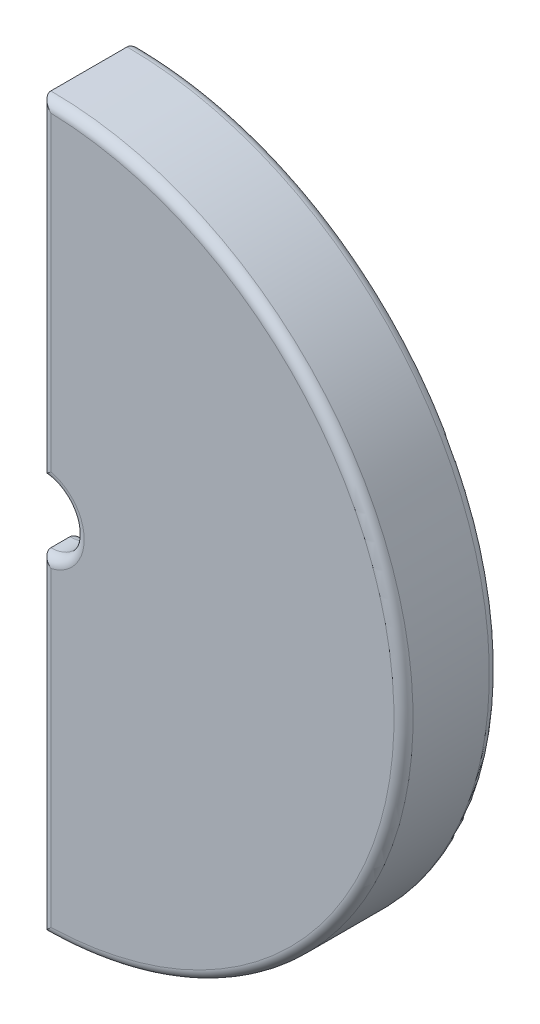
from build123d import *

# Parameters (mm, degrees)
EXTRUDE_1_DEPTH     = 2.5
SKETCH_2_R          = 4.5
CUT_EXTRUDE_1_DEPTH = 3
FILLET_1_R          = 0.5


with BuildPart() as part:
    # Sketch 1 → Extrude 1 (new, symmetric)
    with BuildSketch(Plane.XY):
        with BuildLine():
            Line((0, 1.75), (0, 19))
            ThreePointArc((0, 19), (19, 0), (0, -19))
            Line((0, -19), (0, -1.75))
            ThreePointArc((0, -1.75), (1.75, 0), (0, 1.75))
        make_face()
    extrude(amount=EXTRUDE_1_DEPTH, both=True)

    # Sketch 2 → Cut-Extrude 1 (cut)
    with BuildSketch(Plane(origin=(0, 0, -2.5), x_dir=(-1, 0, 0), z_dir=(0, 0, -1))):
        Circle(SKETCH_2_R)
    extrude(amount=-CUT_EXTRUDE_1_DEPTH, mode=Mode.SUBTRACT)

    # Fillet 1
    fillet_1_edges = [part.edges().sort_by_distance(p)[0] for p in [
        (19, 0, 2.5),
        (0, 10.375, 2.5),
        (0, -11.75, -2.5),
        (0, 3.125, 0.5),
        (4.5, 0, -2.5),
        (4.5, 0, 0.5),
        (0, -4.5, -1),
        (0, 4.5, -1),
        (0, -3.125, 0.5),
        (1.75, 0, 0.5),
        (1.75, 0, 2.5),
        (0, 11.75, -2.5),
        (19, 0, -2.5),
        (0, -10.375, 2.5),
    ]]
    fillet(fillet_1_edges, radius=FILLET_1_R)


solid = part.part
